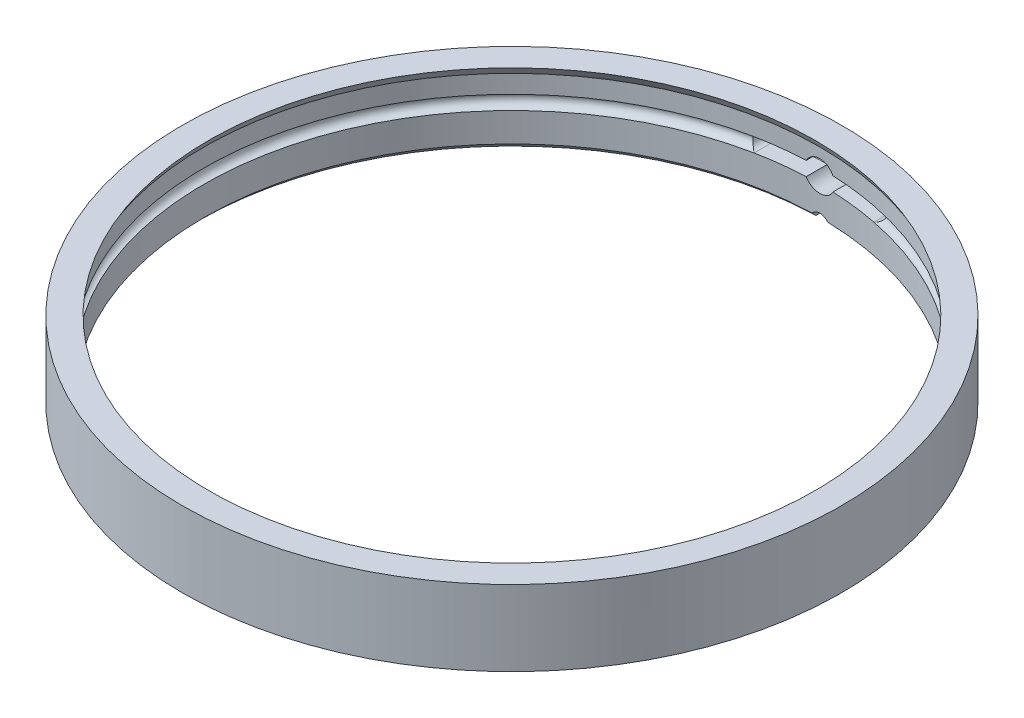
from build123d import *

# Parameters (mm, degrees)
SKETCH1_R               = 83.185
BOSS_EXTRUDE1_DEPTH     = 19.05
SKETCH7_R               = 2.54
CUT_EXTRUDE1_DEPTH      = 12.7
CUT_EXTRUDE2_REACH      = 188.98
CUT_EXTRUDE2_END_RADIUS = 77.7286
SKETCH8_R               = 1.778
SKETCH8_R_2             = 3.81
SKETCH8_W               = 30.226
SKETCH8_H               = 3.556
CHAMFER1_SIZE           = 1.5875


with BuildPart() as part:
    # Sketch1 → Boss-Extrude1 (new body)
    with BuildSketch(Plane(origin=(0, 0, 0), x_dir=(1, 0, 0), z_dir=(0, 1, 0))):
        with Locations(Location((0, 0, 0), (0, 0, 90))):
            Circle(SKETCH1_R)
    extrude(amount=BOSS_EXTRUDE1_DEPTH)

    # Sketch3 → Cut-Revolve1 (revolve, cut)
    with BuildSketch(Plane(origin=(0, 0, 0), x_dir=(0, 0, -1), z_dir=(1, 0, 0))):
        with BuildLine():
            Line((0, 0), (77.7286, 0))
            Line((77.7286, 0), (77.7286, 8.89))
            ThreePointArc((77.7286, 8.89), (79.5066, 10.668), (77.7286, 12.446))
            Line((77.7286, 12.446), (77.7286, 17.018))
            Line((77.7286, 17.018), (76.555424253, 19.05))
            Line((76.555424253, 19.05), (0, 19.05))
            Line((0, 19.05), (0, 0))
        make_face()
    revolve(axis=Axis((0, 0, 0), (0, 1, 0)), mode=Mode.SUBTRACT)

    # Sketch7 → Cut-Extrude1 (cut)
    with BuildSketch(Plane(origin=(0, 0, -83.185), x_dir=(-1, 0, 0), z_dir=(0, 0, -1))):
        Circle(SKETCH7_R)
    extrude(amount=-CUT_EXTRUDE1_DEPTH, mode=Mode.SUBTRACT)

    # Cut-Extrude2: up to this cylinder (the profile starts outside it)
    cut_extrude2_end = Plane(origin=(0, 10.668, 0), z_dir=(0, -1, 0)) * Cylinder(CUT_EXTRUDE2_END_RADIUS, 534.4172, mode=Mode.PRIVATE)
    # Sketch8 → Cut-Extrude2 (cut, up to the surface)
    with BuildSketch(Plane(origin=(0, 0, -83.185), x_dir=(-1, 0, 0), z_dir=(0, 0, -1)), mode=Mode.PRIVATE) as cut_extrude2_sk1:
        with Locations((15.113, 10.668)):
            Circle(SKETCH8_R)
    cut_extrude2_tool1 = extrude(cut_extrude2_sk1.sketch, amount=-CUT_EXTRUDE2_REACH, mode=Mode.PRIVATE) - cut_extrude2_end
    add(cut_extrude2_tool1.solids().sort_by_distance((-15.113, 10.668, -83.185))[0], mode=Mode.SUBTRACT)
    # Sketch8 → Cut-Extrude2 (cut, up to the surface)
    with BuildSketch(Plane(origin=(0, 0, -83.185), x_dir=(-1, 0, 0), z_dir=(0, 0, -1)), mode=Mode.PRIVATE) as cut_extrude2_sk2:
        with Locations((-15.113, 10.668)):
            Circle(SKETCH8_R)
    cut_extrude2_tool2 = extrude(cut_extrude2_sk2.sketch, amount=-CUT_EXTRUDE2_REACH, mode=Mode.PRIVATE) - cut_extrude2_end
    add(cut_extrude2_tool2.solids().sort_by_distance((15.113, 10.668, -83.185))[0], mode=Mode.SUBTRACT)
    # Sketch8 → Cut-Extrude2 (cut, up to the surface)
    with BuildSketch(Plane(origin=(0, 0, -83.185), x_dir=(-1, 0, 0), z_dir=(0, 0, -1)), mode=Mode.PRIVATE) as cut_extrude2_sk3:
        with Locations((0, 10.668)):
            Circle(SKETCH8_R_2)
    cut_extrude2_tool3 = extrude(cut_extrude2_sk3.sketch, amount=-CUT_EXTRUDE2_REACH, mode=Mode.PRIVATE) - cut_extrude2_end
    add(cut_extrude2_tool3.solids().sort_by_distance((0, 10.668, -83.185))[0], mode=Mode.SUBTRACT)
    # Sketch8 → Cut-Extrude2 (cut, up to the surface)
    with BuildSketch(Plane(origin=(0, 0, -83.185), x_dir=(-1, 0, 0), z_dir=(0, 0, -1)), mode=Mode.PRIVATE) as cut_extrude2_sk4:
        with Locations((0, 10.668)):
            Rectangle(SKETCH8_W, SKETCH8_H)
    cut_extrude2_tool4 = extrude(cut_extrude2_sk4.sketch, amount=-CUT_EXTRUDE2_REACH, mode=Mode.PRIVATE) - cut_extrude2_end
    add(cut_extrude2_tool4.solids().sort_by_distance((0, 10.668, -83.185))[0], mode=Mode.SUBTRACT)

    # Chamfer1
    chamfer1_edges = [part.edges().sort_by_distance(p)[0] for p in [
        (0, 0, 77.7286),
    ]]
    chamfer(chamfer1_edges, length=CHAMFER1_SIZE)


solid = part.part
